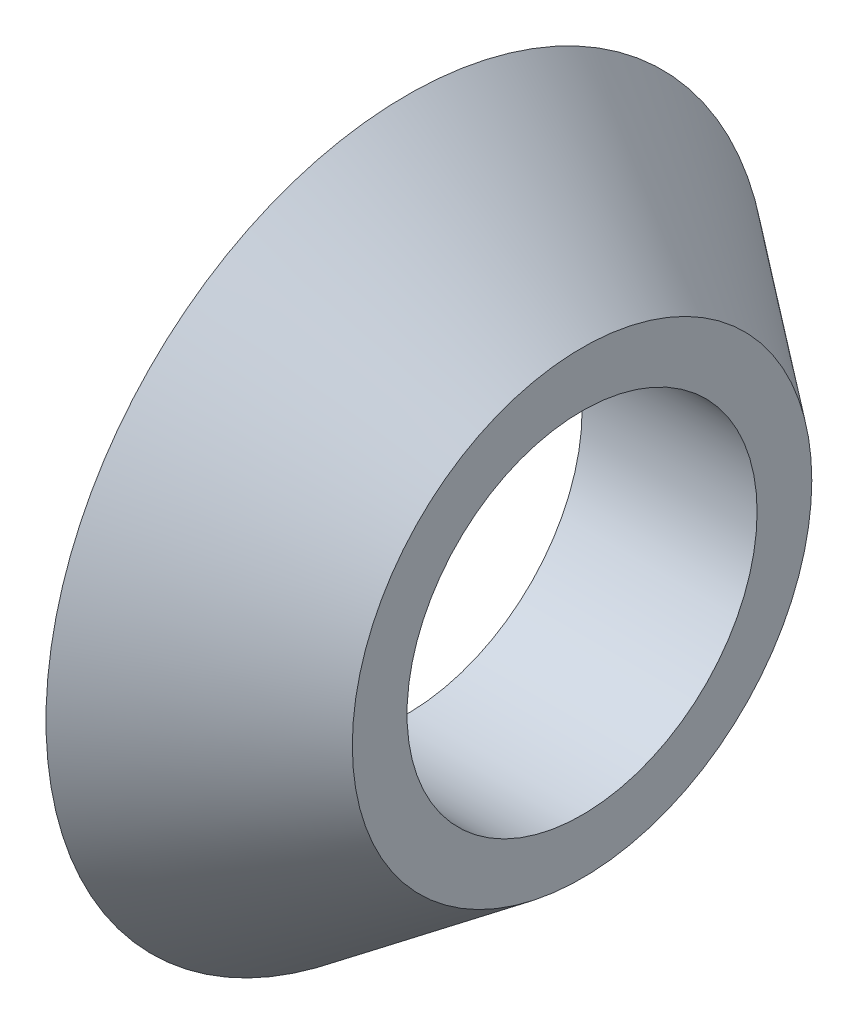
from build123d import *


with BuildPart() as part:
    # Esquisse1 → Base-R_volution (revolve)
    with BuildSketch(Plane.XY, mode=Mode.PRIVATE) as base_r_volution_sk:
        Polygon((-5.5, 4.125), (-3.5, 2.625), (-3.5, 2), (-5.5, 2), align=None)
    revolve(base_r_volution_sk.sketch.rotate(Axis((17.609243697, 0, 0), (-1, 0, 0)), 90), axis=Axis((17.609243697, 0, 0), (-1, 0, 0)))


solid = part.part
